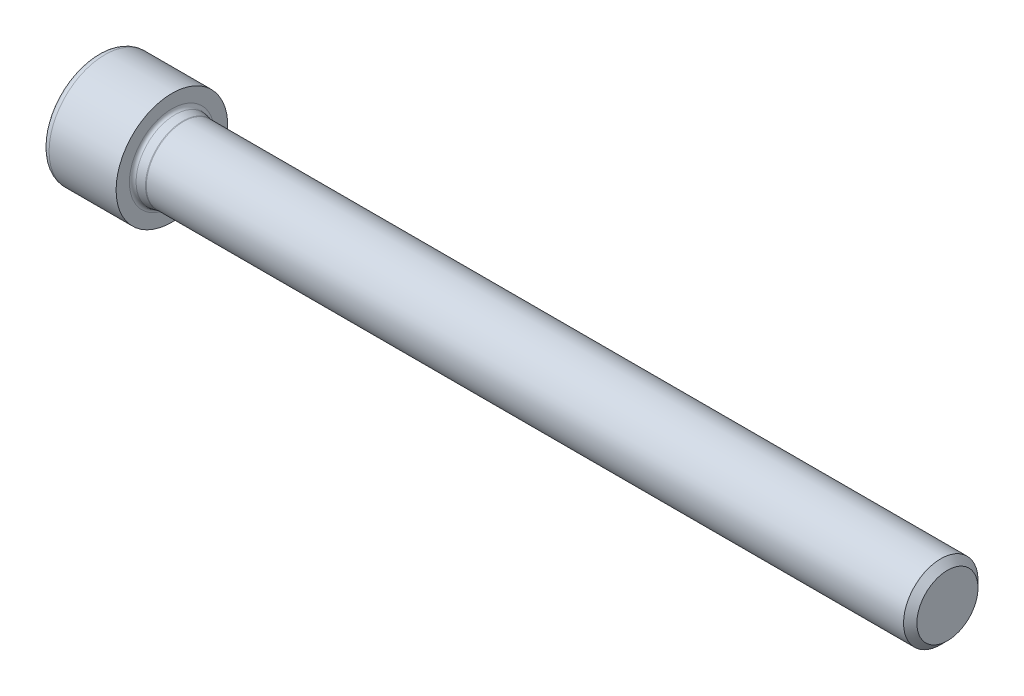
ISO-10303-21;
HEADER;
FILE_DESCRIPTION(('STEP AP214'),'2;1');
FILE_NAME('part.step','',(''),(''),'','','');
FILE_SCHEMA(('AUTOMOTIVE_DESIGN { 1 0 10303 214 1 1 1 1 }'));
ENDSEC;
DATA;
#1=APPLICATION_CONTEXT('core data for automotive mechanical design processes');
#2=APPLICATION_PROTOCOL_DEFINITION('international standard','automotive_design',2000,#1);
#3=PRODUCT_CONTEXT('',#1,'mechanical');
#4=PRODUCT('Part','Part','',(#3));
#5=PRODUCT_RELATED_PRODUCT_CATEGORY('part','',(#4));
#6=PRODUCT_DEFINITION_FORMATION('','',#4);
#7=PRODUCT_DEFINITION_CONTEXT('part definition',#1,'design');
#8=PRODUCT_DEFINITION('design','',#6,#7);
#9=PRODUCT_DEFINITION_SHAPE('','',#8);
#10=(LENGTH_UNIT() NAMED_UNIT(*) SI_UNIT(.MILLI.,.METRE.));
#11=(NAMED_UNIT(*) PLANE_ANGLE_UNIT() SI_UNIT($,.RADIAN.));
#12=(NAMED_UNIT(*) SI_UNIT($,.STERADIAN.) SOLID_ANGLE_UNIT());
#13=UNCERTAINTY_MEASURE_WITH_UNIT(LENGTH_MEASURE(1.E-05),#10,'distance_accuracy_value','');
#14=(GEOMETRIC_REPRESENTATION_CONTEXT(3) GLOBAL_UNCERTAINTY_ASSIGNED_CONTEXT((#13)) GLOBAL_UNIT_ASSIGNED_CONTEXT((#10,
#11,#12)) REPRESENTATION_CONTEXT('',''));
#15=CARTESIAN_POINT('',(0.,0.,0.));
#16=DIRECTION('',(0.,0.,1.));
#17=DIRECTION('',(1.,0.,0.));
#18=AXIS2_PLACEMENT_3D('',#15,#16,#17);
#19=CARTESIAN_POINT('',(-12.,0.,0.));
#20=DIRECTION('',(-1.,0.,0.));
#21=DIRECTION('',(0.,0.,1.));
#22=AXIS2_PLACEMENT_3D('',#19,#20,#21);
#23=CONICAL_SURFACE('',#22,5.715,0.785398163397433);
#24=CARTESIAN_POINT('',(-12.,0.,0.));
#25=DIRECTION('',(-1.,0.,0.));
#26=DIRECTION('',(0.,0.,1.));
#27=AXIS2_PLACEMENT_3D('',#24,#25,#26);
#28=CIRCLE('',#27,5.715);
#29=CARTESIAN_POINT('',(-12.,2.94618112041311,4.89706461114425));
#30=VERTEX_POINT('',#29);
#31=CARTESIAN_POINT('',(-12.,5.71407291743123,0.102935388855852));
#32=VERTEX_POINT('',#31);
#33=EDGE_CURVE('E282',#30,#32,#28,.T.);
#34=ORIENTED_EDGE('',*,*,#33,.T.);
#35=CARTESIAN_POINT('',(-12.0002,5.7142793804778,0.102577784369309));
#36=CARTESIAN_POINT('',(-11.9074807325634,5.61850052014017,0.268471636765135));
#37=CARTESIAN_POINT('',(-11.8204798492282,5.52115568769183,0.437077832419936));
#38=CARTESIAN_POINT('',(-11.6616788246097,5.322857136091,0.780540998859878));
#39=CARTESIAN_POINT('',(-11.5899594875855,5.22188737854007,0.955425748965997));
#40=CARTESIAN_POINT('',(-11.4674205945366,5.01833124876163,1.30799530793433));
#41=CARTESIAN_POINT('',(-11.4163143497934,4.91578923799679,1.4856032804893));
#42=CARTESIAN_POINT('',(-11.3379064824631,4.70861660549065,1.84443680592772));
#43=CARTESIAN_POINT('',(-11.3105521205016,4.60399114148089,2.02565342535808));
#44=CARTESIAN_POINT('',(-11.2858472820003,4.42078631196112,2.34297349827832));
#45=CARTESIAN_POINT('',(-11.2826070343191,4.34239841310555,2.47874532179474));
#46=CARTESIAN_POINT('',(-11.2908807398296,4.18578780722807,2.75000284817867));
#47=CARTESIAN_POINT('',(-11.3023996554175,4.10756516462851,2.8854884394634));
#48=CARTESIAN_POINT('',(-11.3395305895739,3.95190211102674,3.15510475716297));
#49=CARTESIAN_POINT('',(-11.3651560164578,3.87446251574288,3.28923407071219));
#50=CARTESIAN_POINT('',(-11.4291151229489,3.72092999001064,3.5551602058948));
#51=CARTESIAN_POINT('',(-11.4674476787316,3.64483694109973,3.68695723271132));
#52=CARTESIAN_POINT('',(-11.5425556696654,3.51580431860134,3.91044829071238));
#53=CARTESIAN_POINT('',(-11.5766428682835,3.46246508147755,4.00283455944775));
#54=CARTESIAN_POINT('',(-11.6497728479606,3.35664828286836,4.18611463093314));
#55=CARTESIAN_POINT('',(-11.6888152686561,3.30417065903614,4.27700854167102));
#56=CARTESIAN_POINT('',(-11.7711102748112,3.20024952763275,4.45700522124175));
#57=CARTESIAN_POINT('',(-11.8143488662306,3.14880322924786,4.54611282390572));
#58=CARTESIAN_POINT('',(-11.9045865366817,3.04676215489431,4.72285314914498));
#59=CARTESIAN_POINT('',(-11.9515842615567,2.99616708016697,4.81048638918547));
#60=CARTESIAN_POINT('',(-12.0002000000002,2.94597465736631,4.89742221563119));
#61=B_SPLINE_CURVE_WITH_KNOTS('',3,(#35,#36,#37,#38,#39,#40,#41,#42,#43,#44,#45,#46,#47,#48,#49,
#50,#51,#52,#53,#54,#55,#56,#57,#58,#59,#60),.UNSPECIFIED.,.F.,.F.,(4,2,2,2,2,2,2,2,2,2,2,2,4),
(0.,0.638854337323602,1.28100722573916,1.91389253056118,2.54536893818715,3.01512927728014,
3.48504760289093,3.95541336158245,4.42573753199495,4.7615923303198,5.09742271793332,
5.43216928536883,5.76679580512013),.UNSPECIFIED.);
#62=EDGE_CURVE('E247',#32,#30,#61,.T.);
#63=ORIENTED_EDGE('',*,*,#62,.T.);
#64=EDGE_LOOP('',(#34,#63));
#65=FACE_BOUND('',#64,.T.);
#66=ADVANCED_FACE('F37',(#65),#23,.F.);
#67=CARTESIAN_POINT('',(-12.,5.71407291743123,-0.102935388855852));
#68=VERTEX_POINT('',#67);
#69=CARTESIAN_POINT('',(-12.,2.94618112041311,-4.89706461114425));
#70=VERTEX_POINT('',#69);
#71=EDGE_CURVE('E285',#68,#70,#28,.T.);
#72=ORIENTED_EDGE('',*,*,#71,.T.);
#73=CARTESIAN_POINT('',(-12.0002000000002,2.94597465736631,-4.89742221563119));
#74=CARTESIAN_POINT('',(-11.9074807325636,3.04175351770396,-4.73152836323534));
#75=CARTESIAN_POINT('',(-11.8204798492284,3.13909835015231,-4.56292216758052));
#76=CARTESIAN_POINT('',(-11.6616788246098,3.33739690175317,-4.21945900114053));
#77=CARTESIAN_POINT('',(-11.5899594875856,3.43836665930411,-4.04457425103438));
#78=CARTESIAN_POINT('',(-11.4674205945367,3.64192278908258,-3.692004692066));
#79=CARTESIAN_POINT('',(-11.4163143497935,3.74446479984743,-3.51439671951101));
#80=CARTESIAN_POINT('',(-11.3379064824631,3.95163743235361,-3.15556319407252));
#81=CARTESIAN_POINT('',(-11.3105521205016,4.05626289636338,-2.97434657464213));
#82=CARTESIAN_POINT('',(-11.2858472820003,4.23946772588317,-2.65702650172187));
#83=CARTESIAN_POINT('',(-11.2826070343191,4.31785562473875,-2.52125467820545));
#84=CARTESIAN_POINT('',(-11.2908807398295,4.47446623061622,-2.24999715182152));
#85=CARTESIAN_POINT('',(-11.3023996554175,4.55268887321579,-2.11451156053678));
#86=CARTESIAN_POINT('',(-11.3395305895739,4.70835192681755,-1.84489524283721));
#87=CARTESIAN_POINT('',(-11.3651560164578,4.78579152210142,-1.71076592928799));
#88=CARTESIAN_POINT('',(-11.4291151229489,4.93932404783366,-1.44483979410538));
#89=CARTESIAN_POINT('',(-11.4674476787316,5.01541709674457,-1.31304276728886));
#90=CARTESIAN_POINT('',(-11.5425556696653,5.14444971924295,-1.08955170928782));
#91=CARTESIAN_POINT('',(-11.5766428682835,5.19778895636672,-0.997165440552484));
#92=CARTESIAN_POINT('',(-11.6497728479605,5.30360575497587,-0.813885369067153));
#93=CARTESIAN_POINT('',(-11.688815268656,5.35608337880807,-0.722991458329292));
#94=CARTESIAN_POINT('',(-11.7711102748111,5.46000451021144,-0.542994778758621));
#95=CARTESIAN_POINT('',(-11.8143488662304,5.51145080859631,-0.453887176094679));
#96=CARTESIAN_POINT('',(-11.9045865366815,5.61349188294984,-0.277146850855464));
#97=CARTESIAN_POINT('',(-11.9515842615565,5.66408695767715,-0.189513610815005));
#98=CARTESIAN_POINT('',(-12.0002,5.7142793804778,-0.102577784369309));
#99=B_SPLINE_CURVE_WITH_KNOTS('',3,(#73,#74,#75,#76,#77,#78,#79,#80,#81,#82,#83,#84,#85,#86,#87,
#88,#89,#90,#91,#92,#93,#94,#95,#96,#97,#98),.UNSPECIFIED.,.F.,.F.,(4,2,2,2,2,2,2,2,2,2,2,2,4),
(0.,0.638854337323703,1.28100722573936,1.91389253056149,2.54536893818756,3.01512927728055,
3.48504760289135,3.95541336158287,4.42573753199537,4.76159233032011,5.09742271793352,
5.43216928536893,5.76679580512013),.UNSPECIFIED.);
#100=EDGE_CURVE('E242',#70,#68,#99,.T.);
#101=ORIENTED_EDGE('',*,*,#100,.T.);
#102=EDGE_LOOP('',(#72,#101));
#103=FACE_BOUND('',#102,.T.);
#104=ADVANCED_FACE('F273',(#103),#23,.F.);
#105=CARTESIAN_POINT('',(-12.,2.76789179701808,-5.));
#106=VERTEX_POINT('',#105);
#107=CARTESIAN_POINT('',(-12.,-2.76789179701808,-5.));
#108=VERTEX_POINT('',#107);
#109=EDGE_CURVE('E291',#106,#108,#28,.T.);
#110=ORIENTED_EDGE('',*,*,#109,.T.);
#111=CARTESIAN_POINT('',(-14.0958810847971,-6.00082188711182,-5.));
#112=CARTESIAN_POINT('',(-13.9844552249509,-5.85575345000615,-5.));
#113=CARTESIAN_POINT('',(-13.8740344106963,-5.70990068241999,-5.));
#114=CARTESIAN_POINT('',(-13.6556612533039,-5.41630686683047,-5.));
#115=CARTESIAN_POINT('',(-13.5477095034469,-5.26856537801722,-5.));
#116=CARTESIAN_POINT('',(-13.3339645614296,-4.96979459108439,-5.));
#117=CARTESIAN_POINT('',(-13.2281944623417,-4.81874871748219,-5.));
#118=CARTESIAN_POINT('',(-13.020357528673,-4.51413854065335,-5.));
#119=CARTESIAN_POINT('',(-12.9182904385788,-4.36057441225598,-5.));
#120=CARTESIAN_POINT('',(-12.7124289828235,-4.04076170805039,-5.));
#121=CARTESIAN_POINT('',(-12.6089292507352,-3.87432252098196,-5.));
#122=CARTESIAN_POINT('',(-12.4083862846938,-3.53753716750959,-5.));
#123=CARTESIAN_POINT('',(-12.3113441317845,-3.36719035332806,-5.));
#124=CARTESIAN_POINT('',(-12.1257854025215,-3.02254857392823,-5.));
#125=CARTESIAN_POINT('',(-12.0372437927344,-2.84826719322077,-5.));
#126=CARTESIAN_POINT('',(-11.8706698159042,-2.49479232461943,-5.));
#127=CARTESIAN_POINT('',(-11.7926325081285,-2.31560119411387,-5.));
#128=CARTESIAN_POINT('',(-11.6568266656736,-1.96959427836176,-5.));
#129=CARTESIAN_POINT('',(-11.5978255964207,-1.80326723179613,-5.));
#130=CARTESIAN_POINT('',(-11.4931390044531,-1.46639577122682,-5.));
#131=CARTESIAN_POINT('',(-11.4474543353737,-1.29585108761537,-5.));
#132=CARTESIAN_POINT('',(-11.3726268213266,-0.954521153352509,-5.));
#133=CARTESIAN_POINT('',(-11.3431850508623,-0.783802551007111,-5.));
#134=CARTESIAN_POINT('',(-11.3014540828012,-0.440270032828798,-5.));
#135=CARTESIAN_POINT('',(-11.2891613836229,-0.26745655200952,-5.));
#136=CARTESIAN_POINT('',(-11.2827640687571,0.0710713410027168,-5.));
#137=CARTESIAN_POINT('',(-11.2879002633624,0.236771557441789,-5.));
#138=CARTESIAN_POINT('',(-11.3143396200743,0.566868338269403,-5.));
#139=CARTESIAN_POINT('',(-11.3356442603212,0.731264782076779,-5.));
#140=CARTESIAN_POINT('',(-11.3935817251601,1.06034957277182,-5.));
#141=CARTESIAN_POINT('',(-11.4304843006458,1.22498962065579,-5.));
#142=CARTESIAN_POINT('',(-11.517577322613,1.55064779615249,-5.));
#143=CARTESIAN_POINT('',(-11.5677669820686,1.71166613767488,-5.));
#144=CARTESIAN_POINT('',(-11.6826139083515,2.0394163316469,-5.));
#145=CARTESIAN_POINT('',(-11.747963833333,2.20590271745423,-5.));
#146=CARTESIAN_POINT('',(-11.8887553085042,2.53459014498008,-5.));
#147=CARTESIAN_POINT('',(-11.9642014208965,2.69678920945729,-5.));
#148=CARTESIAN_POINT('',(-12.1233957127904,3.01766998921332,-5.));
#149=CARTESIAN_POINT('',(-12.2071695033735,3.17633889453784,-5.));
#150=CARTESIAN_POINT('',(-12.3811749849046,3.49003975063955,-5.));
#151=CARTESIAN_POINT('',(-12.471405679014,3.6450722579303,-5.));
#152=CARTESIAN_POINT('',(-12.6524775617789,3.94439554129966,-5.));
#153=CARTESIAN_POINT('',(-12.7430683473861,4.08883860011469,-5.));
#154=CARTESIAN_POINT('',(-12.9281026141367,4.37524319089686,-5.));
#155=CARTESIAN_POINT('',(-13.0225463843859,4.51720453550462,-5.));
#156=CARTESIAN_POINT('',(-13.2138296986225,4.79782824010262,-5.));
#157=CARTESIAN_POINT('',(-13.3106438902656,4.93650794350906,-5.));
#158=CARTESIAN_POINT('',(-13.5068650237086,5.21196535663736,-5.));
#159=CARTESIAN_POINT('',(-13.6062712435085,5.34874358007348,-5.));
#160=CARTESIAN_POINT('',(-13.706738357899,5.484724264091,-5.));
#161=B_SPLINE_CURVE_WITH_KNOTS('',3,(#111,#112,#113,#114,#115,#116,#117,#118,#119,#120,#121,
#122,#123,#124,#125,#126,#127,#128,#129,#130,#131,#132,#133,#134,#135,#136,#137,#138,#139,#140,
#141,#142,#143,#144,#145,#146,#147,#148,#149,#150,#151,#152,#153,#154,#155,#156,#157,#158,#159,
#160),.UNSPECIFIED.,.F.,.F.,(4,2,2,2,2,2,2,2,2,2,2,2,2,2,2,2,2,2,2,2,2,2,2,2,4),(0.,
0.548777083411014,1.09768467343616,1.65082914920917,2.20393538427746,2.7918051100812,
3.37977300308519,3.96595254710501,4.55185540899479,5.08084366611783,5.60986582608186,
6.12879642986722,6.64762106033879,7.14414134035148,7.64070701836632,8.1462363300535,
8.65173570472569,9.18788255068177,9.72427249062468,10.2623663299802,10.8003772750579,
11.3118076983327,11.8232765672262,12.3306351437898,12.8378538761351),.UNSPECIFIED.);
#162=EDGE_CURVE('E236',#108,#106,#161,.T.);
#163=ORIENTED_EDGE('',*,*,#162,.T.);
#164=EDGE_LOOP('',(#110,#163));
#165=FACE_BOUND('',#164,.T.);
#166=ADVANCED_FACE('F278',(#165),#23,.F.);
#167=CARTESIAN_POINT('',(-12.,-2.94618112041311,-4.89706461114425));
#168=VERTEX_POINT('',#167);
#169=CARTESIAN_POINT('',(-12.,-5.71407291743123,-0.102935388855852));
#170=VERTEX_POINT('',#169);
#171=EDGE_CURVE('E298',#168,#170,#28,.T.);
#172=ORIENTED_EDGE('',*,*,#171,.T.);
#173=CARTESIAN_POINT('',(-12.0002,-5.7142793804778,-0.102577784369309));
#174=CARTESIAN_POINT('',(-11.9074807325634,-5.61850052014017,-0.268471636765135));
#175=CARTESIAN_POINT('',(-11.8204798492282,-5.52115568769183,-0.437077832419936));
#176=CARTESIAN_POINT('',(-11.6616788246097,-5.322857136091,-0.780540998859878));
#177=CARTESIAN_POINT('',(-11.5899594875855,-5.22188737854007,-0.955425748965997));
#178=CARTESIAN_POINT('',(-11.4674205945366,-5.01833124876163,-1.30799530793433));
#179=CARTESIAN_POINT('',(-11.4163143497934,-4.91578923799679,-1.4856032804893));
#180=CARTESIAN_POINT('',(-11.3379064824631,-4.70861660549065,-1.84443680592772));
#181=CARTESIAN_POINT('',(-11.3105521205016,-4.60399114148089,-2.02565342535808));
#182=CARTESIAN_POINT('',(-11.2858472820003,-4.42078631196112,-2.34297349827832));
#183=CARTESIAN_POINT('',(-11.2826070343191,-4.34239841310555,-2.47874532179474));
#184=CARTESIAN_POINT('',(-11.2908807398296,-4.18578780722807,-2.75000284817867));
#185=CARTESIAN_POINT('',(-11.3023996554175,-4.10756516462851,-2.8854884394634));
#186=CARTESIAN_POINT('',(-11.3395305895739,-3.95190211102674,-3.15510475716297));
#187=CARTESIAN_POINT('',(-11.3651560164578,-3.87446251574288,-3.28923407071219));
#188=CARTESIAN_POINT('',(-11.4291151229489,-3.72092999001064,-3.5551602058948));
#189=CARTESIAN_POINT('',(-11.4674476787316,-3.64483694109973,-3.68695723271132));
#190=CARTESIAN_POINT('',(-11.5425556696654,-3.51580431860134,-3.91044829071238));
#191=CARTESIAN_POINT('',(-11.5766428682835,-3.46246508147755,-4.00283455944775));
#192=CARTESIAN_POINT('',(-11.6497728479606,-3.35664828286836,-4.18611463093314));
#193=CARTESIAN_POINT('',(-11.6888152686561,-3.30417065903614,-4.27700854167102));
#194=CARTESIAN_POINT('',(-11.7711102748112,-3.20024952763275,-4.45700522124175));
#195=CARTESIAN_POINT('',(-11.8143488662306,-3.14880322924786,-4.54611282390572));
#196=CARTESIAN_POINT('',(-11.9045865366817,-3.04676215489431,-4.72285314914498));
#197=CARTESIAN_POINT('',(-11.9515842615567,-2.99616708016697,-4.81048638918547));
#198=CARTESIAN_POINT('',(-12.0002000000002,-2.94597465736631,-4.89742221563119));
#199=B_SPLINE_CURVE_WITH_KNOTS('',3,(#173,#174,#175,#176,#177,#178,#179,#180,#181,#182,#183,
#184,#185,#186,#187,#188,#189,#190,#191,#192,#193,#194,#195,#196,#197,#198),.UNSPECIFIED.,.F.,
.F.,(4,2,2,2,2,2,2,2,2,2,2,2,4),(0.,0.638854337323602,1.28100722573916,1.91389253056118,
2.54536893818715,3.01512927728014,3.48504760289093,3.95541336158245,4.42573753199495,
4.7615923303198,5.09742271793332,5.43216928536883,5.76679580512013),.UNSPECIFIED.);
#200=EDGE_CURVE('E230',#170,#168,#199,.T.);
#201=ORIENTED_EDGE('',*,*,#200,.T.);
#202=EDGE_LOOP('',(#172,#201));
#203=FACE_BOUND('',#202,.T.);
#204=ADVANCED_FACE('F465',(#203),#23,.F.);
#205=CARTESIAN_POINT('',(-12.,-5.71407291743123,0.102935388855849));
#206=VERTEX_POINT('',#205);
#207=CARTESIAN_POINT('',(-12.,-2.94618112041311,4.89706461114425));
#208=VERTEX_POINT('',#207);
#209=EDGE_CURVE('E294',#206,#208,#28,.T.);
#210=ORIENTED_EDGE('',*,*,#209,.T.);
#211=CARTESIAN_POINT('',(-12.0002000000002,-2.94597465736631,4.89742221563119));
#212=CARTESIAN_POINT('',(-11.9074807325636,-3.04175351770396,4.73152836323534));
#213=CARTESIAN_POINT('',(-11.8204798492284,-3.13909835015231,4.56292216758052));
#214=CARTESIAN_POINT('',(-11.6616788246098,-3.33739690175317,4.21945900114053));
#215=CARTESIAN_POINT('',(-11.5899594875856,-3.43836665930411,4.04457425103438));
#216=CARTESIAN_POINT('',(-11.4674205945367,-3.64192278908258,3.692004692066));
#217=CARTESIAN_POINT('',(-11.4163143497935,-3.74446479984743,3.51439671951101));
#218=CARTESIAN_POINT('',(-11.3379064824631,-3.95163743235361,3.15556319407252));
#219=CARTESIAN_POINT('',(-11.3105521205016,-4.05626289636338,2.97434657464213));
#220=CARTESIAN_POINT('',(-11.2858472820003,-4.23946772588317,2.65702650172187));
#221=CARTESIAN_POINT('',(-11.2826070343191,-4.31785562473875,2.52125467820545));
#222=CARTESIAN_POINT('',(-11.2908807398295,-4.47446623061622,2.24999715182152));
#223=CARTESIAN_POINT('',(-11.3023996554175,-4.55268887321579,2.11451156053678));
#224=CARTESIAN_POINT('',(-11.3395305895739,-4.70835192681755,1.84489524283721));
#225=CARTESIAN_POINT('',(-11.3651560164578,-4.78579152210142,1.71076592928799));
#226=CARTESIAN_POINT('',(-11.4291151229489,-4.93932404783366,1.44483979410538));
#227=CARTESIAN_POINT('',(-11.4674476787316,-5.01541709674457,1.31304276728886));
#228=CARTESIAN_POINT('',(-11.5425556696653,-5.14444971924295,1.08955170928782));
#229=CARTESIAN_POINT('',(-11.5766428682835,-5.19778895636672,0.997165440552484));
#230=CARTESIAN_POINT('',(-11.6497728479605,-5.30360575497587,0.813885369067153));
#231=CARTESIAN_POINT('',(-11.688815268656,-5.35608337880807,0.722991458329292));
#232=CARTESIAN_POINT('',(-11.7711102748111,-5.46000451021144,0.542994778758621));
#233=CARTESIAN_POINT('',(-11.8143488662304,-5.51145080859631,0.453887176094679));
#234=CARTESIAN_POINT('',(-11.9045865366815,-5.61349188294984,0.277146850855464));
#235=CARTESIAN_POINT('',(-11.9515842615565,-5.66408695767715,0.189513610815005));
#236=CARTESIAN_POINT('',(-12.0002,-5.7142793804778,0.102577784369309));
#237=B_SPLINE_CURVE_WITH_KNOTS('',3,(#211,#212,#213,#214,#215,#216,#217,#218,#219,#220,#221,
#222,#223,#224,#225,#226,#227,#228,#229,#230,#231,#232,#233,#234,#235,#236),.UNSPECIFIED.,.F.,
.F.,(4,2,2,2,2,2,2,2,2,2,2,2,4),(0.,0.638854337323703,1.28100722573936,1.91389253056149,
2.54536893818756,3.01512927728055,3.48504760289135,3.95541336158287,4.42573753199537,
4.76159233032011,5.09742271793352,5.43216928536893,5.76679580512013),.UNSPECIFIED.);
#238=EDGE_CURVE('E208',#208,#206,#237,.T.);
#239=ORIENTED_EDGE('',*,*,#238,.T.);
#240=EDGE_LOOP('',(#210,#239));
#241=FACE_BOUND('',#240,.T.);
#242=ADVANCED_FACE('F221',(#241),#23,.F.);
#243=CARTESIAN_POINT('',(-12.,-2.76789179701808,5.));
#244=VERTEX_POINT('',#243);
#245=CARTESIAN_POINT('',(-12.,2.76789179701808,5.));
#246=VERTEX_POINT('',#245);
#247=EDGE_CURVE('E287',#244,#246,#28,.T.);
#248=ORIENTED_EDGE('',*,*,#247,.T.);
#249=CARTESIAN_POINT('',(-14.0958810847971,-6.00082188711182,5.));
#250=CARTESIAN_POINT('',(-13.9844552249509,-5.85575345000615,5.));
#251=CARTESIAN_POINT('',(-13.8740344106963,-5.70990068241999,5.));
#252=CARTESIAN_POINT('',(-13.6556612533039,-5.41630686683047,5.));
#253=CARTESIAN_POINT('',(-13.5477095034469,-5.26856537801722,5.));
#254=CARTESIAN_POINT('',(-13.3339645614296,-4.96979459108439,5.));
#255=CARTESIAN_POINT('',(-13.2281944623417,-4.81874871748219,5.));
#256=CARTESIAN_POINT('',(-13.020357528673,-4.51413854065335,5.));
#257=CARTESIAN_POINT('',(-12.9182904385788,-4.36057441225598,5.));
#258=CARTESIAN_POINT('',(-12.7124289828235,-4.04076170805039,5.));
#259=CARTESIAN_POINT('',(-12.6089292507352,-3.87432252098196,5.));
#260=CARTESIAN_POINT('',(-12.4083862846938,-3.53753716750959,5.));
#261=CARTESIAN_POINT('',(-12.3113441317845,-3.36719035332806,5.));
#262=CARTESIAN_POINT('',(-12.1257854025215,-3.02254857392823,5.));
#263=CARTESIAN_POINT('',(-12.0372437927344,-2.84826719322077,5.));
#264=CARTESIAN_POINT('',(-11.8706698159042,-2.49479232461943,5.));
#265=CARTESIAN_POINT('',(-11.7926325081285,-2.31560119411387,5.));
#266=CARTESIAN_POINT('',(-11.6568266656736,-1.96959427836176,5.));
#267=CARTESIAN_POINT('',(-11.5978255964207,-1.80326723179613,5.));
#268=CARTESIAN_POINT('',(-11.4931390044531,-1.46639577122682,5.));
#269=CARTESIAN_POINT('',(-11.4474543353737,-1.29585108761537,5.));
#270=CARTESIAN_POINT('',(-11.3726268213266,-0.954521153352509,5.));
#271=CARTESIAN_POINT('',(-11.3431850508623,-0.783802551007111,5.));
#272=CARTESIAN_POINT('',(-11.3014540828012,-0.440270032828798,5.));
#273=CARTESIAN_POINT('',(-11.2891613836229,-0.26745655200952,5.));
#274=CARTESIAN_POINT('',(-11.2827640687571,0.0710713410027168,5.));
#275=CARTESIAN_POINT('',(-11.2879002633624,0.236771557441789,5.));
#276=CARTESIAN_POINT('',(-11.3143396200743,0.566868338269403,5.));
#277=CARTESIAN_POINT('',(-11.3356442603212,0.731264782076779,5.));
#278=CARTESIAN_POINT('',(-11.3935817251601,1.06034957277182,5.));
#279=CARTESIAN_POINT('',(-11.4304843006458,1.22498962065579,5.));
#280=CARTESIAN_POINT('',(-11.517577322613,1.55064779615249,5.));
#281=CARTESIAN_POINT('',(-11.5677669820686,1.71166613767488,5.));
#282=CARTESIAN_POINT('',(-11.6826139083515,2.0394163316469,5.));
#283=CARTESIAN_POINT('',(-11.747963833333,2.20590271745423,5.));
#284=CARTESIAN_POINT('',(-11.8887553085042,2.53459014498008,5.));
#285=CARTESIAN_POINT('',(-11.9642014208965,2.69678920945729,5.));
#286=CARTESIAN_POINT('',(-12.1233957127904,3.01766998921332,5.));
#287=CARTESIAN_POINT('',(-12.2071695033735,3.17633889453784,5.));
#288=CARTESIAN_POINT('',(-12.3811749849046,3.49003975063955,5.));
#289=CARTESIAN_POINT('',(-12.471405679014,3.6450722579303,5.));
#290=CARTESIAN_POINT('',(-12.6524775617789,3.94439554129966,5.));
#291=CARTESIAN_POINT('',(-12.7430683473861,4.08883860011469,5.));
#292=CARTESIAN_POINT('',(-12.9281026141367,4.37524319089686,5.));
#293=CARTESIAN_POINT('',(-13.0225463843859,4.51720453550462,5.));
#294=CARTESIAN_POINT('',(-13.2138296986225,4.79782824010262,5.));
#295=CARTESIAN_POINT('',(-13.3106438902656,4.93650794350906,5.));
#296=CARTESIAN_POINT('',(-13.5068650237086,5.21196535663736,5.));
#297=CARTESIAN_POINT('',(-13.6062712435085,5.34874358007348,5.));
#298=CARTESIAN_POINT('',(-13.706738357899,5.484724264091,5.));
#299=B_SPLINE_CURVE_WITH_KNOTS('',3,(#249,#250,#251,#252,#253,#254,#255,#256,#257,#258,#259,
#260,#261,#262,#263,#264,#265,#266,#267,#268,#269,#270,#271,#272,#273,#274,#275,#276,#277,#278,
#279,#280,#281,#282,#283,#284,#285,#286,#287,#288,#289,#290,#291,#292,#293,#294,#295,#296,#297,
#298),.UNSPECIFIED.,.F.,.F.,(4,2,2,2,2,2,2,2,2,2,2,2,2,2,2,2,2,2,2,2,2,2,2,2,4),(0.,
0.548777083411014,1.09768467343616,1.65082914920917,2.20393538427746,2.7918051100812,
3.37977300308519,3.96595254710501,4.55185540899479,5.08084366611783,5.60986582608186,
6.12879642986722,6.64762106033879,7.14414134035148,7.64070701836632,8.1462363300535,
8.65173570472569,9.18788255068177,9.72427249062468,10.2623663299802,10.8003772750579,
11.3118076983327,11.8232765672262,12.3306351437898,12.8378538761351),.UNSPECIFIED.);
#300=EDGE_CURVE('E195',#246,#244,#299,.F.);
#301=ORIENTED_EDGE('',*,*,#300,.T.);
#302=EDGE_LOOP('',(#248,#301));
#303=FACE_BOUND('',#302,.T.);
#304=ADVANCED_FACE('F216',(#303),#23,.F.);
#305=CARTESIAN_POINT('',(-12.,0.,-5.715));
#306=DIRECTION('',(1.,0.,0.));
#307=DIRECTION('',(0.,0.,-1.));
#308=AXIS2_PLACEMENT_3D('',#305,#306,#307);
#309=PLANE('',#308);
#310=DIRECTION('',(0.,0.500000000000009,0.866025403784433));
#311=VECTOR('',#310,1.);
#312=CARTESIAN_POINT('',(-12.,1.85545942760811,-6.78625));
#313=LINE('',#312,#311);
#314=CARTESIAN_POINT('',(-12.,5.7735026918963,0.));
#315=VERTEX_POINT('',#314);
#316=EDGE_CURVE('E46',#68,#315,#313,.T.);
#317=ORIENTED_EDGE('',*,*,#316,.T.);
#318=DIRECTION('',(0.,-0.500000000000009,0.866025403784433));
#319=VECTOR('',#318,1.);
#320=CARTESIAN_POINT('',(-12.,6.80479461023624,-1.7862499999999));
#321=LINE('',#320,#319);
#322=EDGE_CURVE('E11',#315,#32,#321,.T.);
#323=ORIENTED_EDGE('',*,*,#322,.T.);
#324=ORIENTED_EDGE('',*,*,#33,.F.);
#325=CARTESIAN_POINT('',(-12.,2.8867513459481,5.));
#326=VERTEX_POINT('',#325);
#327=EDGE_CURVE('E48',#30,#326,#321,.T.);
#328=ORIENTED_EDGE('',*,*,#327,.T.);
#329=DIRECTION('',(0.,-1.,0.));
#330=VECTOR('',#329,1.);
#331=CARTESIAN_POINT('',(-12.,0.,5.));
#332=LINE('',#331,#330);
#333=EDGE_CURVE('E170',#326,#246,#332,.T.);
#334=ORIENTED_EDGE('',*,*,#333,.T.);
#335=ORIENTED_EDGE('',*,*,#247,.F.);
#336=CARTESIAN_POINT('',(-12.,-2.8867513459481,5.));
#337=VERTEX_POINT('',#336);
#338=EDGE_CURVE('E408',#244,#337,#332,.T.);
#339=ORIENTED_EDGE('',*,*,#338,.T.);
#340=DIRECTION('',(0.,-0.500000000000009,-0.866025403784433));
#341=VECTOR('',#340,1.);
#342=CARTESIAN_POINT('',(-12.,-6.80479461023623,-1.7862499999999));
#343=LINE('',#342,#341);
#344=EDGE_CURVE('E405',#337,#208,#343,.T.);
#345=ORIENTED_EDGE('',*,*,#344,.T.);
#346=ORIENTED_EDGE('',*,*,#209,.F.);
#347=CARTESIAN_POINT('',(-12.,-5.7735026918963,0.));
#348=VERTEX_POINT('',#347);
#349=EDGE_CURVE('E403',#206,#348,#343,.T.);
#350=ORIENTED_EDGE('',*,*,#349,.T.);
#351=DIRECTION('',(0.,0.500000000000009,-0.866025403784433));
#352=VECTOR('',#351,1.);
#353=CARTESIAN_POINT('',(-12.,-1.85545942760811,-6.78625));
#354=LINE('',#353,#352);
#355=EDGE_CURVE('E401',#348,#170,#354,.T.);
#356=ORIENTED_EDGE('',*,*,#355,.T.);
#357=ORIENTED_EDGE('',*,*,#171,.F.);
#358=CARTESIAN_POINT('',(-12.,-2.8867513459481,-5.));
#359=VERTEX_POINT('',#358);
#360=EDGE_CURVE('E399',#168,#359,#354,.T.);
#361=ORIENTED_EDGE('',*,*,#360,.T.);
#362=DIRECTION('',(0.,1.,0.));
#363=VECTOR('',#362,1.);
#364=CARTESIAN_POINT('',(-12.,0.,-5.));
#365=LINE('',#364,#363);
#366=EDGE_CURVE('E395',#359,#108,#365,.T.);
#367=ORIENTED_EDGE('',*,*,#366,.T.);
#368=ORIENTED_EDGE('',*,*,#109,.F.);
#369=CARTESIAN_POINT('',(-12.,2.8867513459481,-5.));
#370=VERTEX_POINT('',#369);
#371=EDGE_CURVE('E393',#106,#370,#365,.T.);
#372=ORIENTED_EDGE('',*,*,#371,.T.);
#373=EDGE_CURVE('E41',#370,#70,#313,.T.);
#374=ORIENTED_EDGE('',*,*,#373,.T.);
#375=ORIENTED_EDGE('',*,*,#71,.F.);
#376=EDGE_LOOP('',(#317,#323,#324,#328,#334,#335,#339,#345,#346,#350,#356,#357,#361,#367,#368,
#372,#374,#375));
#377=FACE_BOUND('',#376,.T.);
#378=CARTESIAN_POINT('',(-12.,0.,0.));
#379=DIRECTION('',(-1.,0.,0.));
#380=DIRECTION('',(0.,0.,1.));
#381=AXIS2_PLACEMENT_3D('',#378,#379,#380);
#382=CIRCLE('',#381,7.8);
#383=CARTESIAN_POINT('',(-12.,0.,7.8));
#384=VERTEX_POINT('',#383);
#385=EDGE_CURVE('E295',#384,#384,#382,.T.);
#386=ORIENTED_EDGE('',*,*,#385,.T.);
#387=EDGE_LOOP('',(#386));
#388=FACE_BOUND('',#387,.T.);
#389=ADVANCED_FACE('F220',(#377,#388),#309,.F.);
#390=CARTESIAN_POINT('',(-10.8000000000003,0.,0.));
#391=DIRECTION('',(-1.,0.,0.));
#392=DIRECTION('',(0.,0.,1.));
#393=AXIS2_PLACEMENT_3D('',#390,#391,#392);
#394=TOROIDAL_SURFACE('',#393,7.80000000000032,1.19999999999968);
#395=ORIENTED_EDGE('',*,*,#385,.F.);
#396=EDGE_LOOP('',(#395));
#397=FACE_BOUND('',#396,.T.);
#398=CARTESIAN_POINT('',(-10.8,0.,0.));
#399=DIRECTION('',(-1.,0.,0.));
#400=DIRECTION('',(0.,0.,1.));
#401=AXIS2_PLACEMENT_3D('',#398,#399,#400);
#402=CIRCLE('',#401,9.);
#403=CARTESIAN_POINT('',(-10.8,0.,9.));
#404=VERTEX_POINT('',#403);
#405=EDGE_CURVE('E300',#404,#404,#402,.T.);
#406=ORIENTED_EDGE('',*,*,#405,.T.);
#407=EDGE_LOOP('',(#406));
#408=FACE_BOUND('',#407,.T.);
#409=ADVANCED_FACE('F365',(#397,#408),#394,.T.);
#410=CARTESIAN_POINT('',(125.,0.,0.));
#411=DIRECTION('',(-1.,0.,0.));
#412=DIRECTION('',(0.,0.,1.));
#413=AXIS2_PLACEMENT_3D('',#410,#411,#412);
#414=CYLINDRICAL_SURFACE('',#413,9.);
#415=ORIENTED_EDGE('',*,*,#405,.F.);
#416=EDGE_LOOP('',(#415));
#417=FACE_BOUND('',#416,.T.);
#418=CARTESIAN_POINT('',(0.,0.,0.));
#419=DIRECTION('',(-1.,0.,0.));
#420=DIRECTION('',(0.,0.,1.));
#421=AXIS2_PLACEMENT_3D('',#418,#419,#420);
#422=CIRCLE('',#421,9.);
#423=CARTESIAN_POINT('',(0.,0.,9.));
#424=VERTEX_POINT('',#423);
#425=EDGE_CURVE('E304',#424,#424,#422,.T.);
#426=ORIENTED_EDGE('',*,*,#425,.T.);
#427=EDGE_LOOP('',(#426));
#428=FACE_BOUND('',#427,.T.);
#429=ADVANCED_FACE('F362',(#417,#428),#414,.T.);
#430=CARTESIAN_POINT('',(0.,0.,-9.));
#431=DIRECTION('',(-1.,0.,0.));
#432=DIRECTION('',(0.,0.,1.));
#433=AXIS2_PLACEMENT_3D('',#430,#431,#432);
#434=PLANE('',#433);
#435=ORIENTED_EDGE('',*,*,#425,.F.);
#436=EDGE_LOOP('',(#435));
#437=FACE_BOUND('',#436,.T.);
#438=CARTESIAN_POINT('',(0.,0.,0.));
#439=DIRECTION('',(-1.,0.,0.));
#440=DIRECTION('',(0.,0.,1.));
#441=AXIS2_PLACEMENT_3D('',#438,#439,#440);
#442=CIRCLE('',#441,6.85);
#443=CARTESIAN_POINT('',(0.,0.,6.85));
#444=VERTEX_POINT('',#443);
#445=EDGE_CURVE('E309',#444,#444,#442,.T.);
#446=ORIENTED_EDGE('',*,*,#445,.T.);
#447=EDGE_LOOP('',(#446));
#448=FACE_BOUND('',#447,.T.);
#449=ADVANCED_FACE('F358',(#437,#448),#434,.F.);
#450=CARTESIAN_POINT('',(0.600000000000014,0.,0.));
#451=DIRECTION('',(-1.,0.,0.));
#452=DIRECTION('',(0.,0.,1.));
#453=AXIS2_PLACEMENT_3D('',#450,#451,#452);
#454=TOROIDAL_SURFACE('',#453,6.85,0.600000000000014);
#455=ORIENTED_EDGE('',*,*,#445,.F.);
#456=EDGE_LOOP('',(#455));
#457=FACE_BOUND('',#456,.T.);
#458=CARTESIAN_POINT('',(0.484113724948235,0.,0.));
#459=DIRECTION('',(-1.,0.,0.));
#460=DIRECTION('',(0.,0.,1.));
#461=AXIS2_PLACEMENT_3D('',#458,#459,#460);
#462=CIRCLE('',#461,6.261297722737);
#463=CARTESIAN_POINT('',(0.484113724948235,0.,6.261297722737));
#464=VERTEX_POINT('',#463);
#465=EDGE_CURVE('E312',#464,#464,#462,.T.);
#466=ORIENTED_EDGE('',*,*,#465,.T.);
#467=EDGE_LOOP('',(#466));
#468=FACE_BOUND('',#467,.T.);
#469=ADVANCED_FACE('F354',(#457,#468),#454,.F.);
#470=CARTESIAN_POINT('',(1.7541137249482,0.,0.));
#471=DIRECTION('',(-1.,0.,0.));
#472=DIRECTION('',(0.,0.,1.));
#473=AXIS2_PLACEMENT_3D('',#470,#471,#472);
#474=CONICAL_SURFACE('',#473,6.011297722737,0.194365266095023);
#475=ORIENTED_EDGE('',*,*,#465,.F.);
#476=EDGE_LOOP('',(#475));
#477=FACE_BOUND('',#476,.T.);
#478=CARTESIAN_POINT('',(1.7541137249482,0.,0.));
#479=DIRECTION('',(-1.,0.,0.));
#480=DIRECTION('',(0.,0.,1.));
#481=AXIS2_PLACEMENT_3D('',#478,#479,#480);
#482=CIRCLE('',#481,6.011297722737);
#483=CARTESIAN_POINT('',(1.7541137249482,0.,6.011297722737));
#484=VERTEX_POINT('',#483);
#485=EDGE_CURVE('E315',#484,#484,#482,.T.);
#486=ORIENTED_EDGE('',*,*,#485,.T.);
#487=EDGE_LOOP('',(#486));
#488=FACE_BOUND('',#487,.T.);
#489=ADVANCED_FACE('F350',(#477,#488),#474,.T.);
#490=CARTESIAN_POINT('',(1.86999999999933,0.,0.));
#491=DIRECTION('',(-1.,0.,0.));
#492=DIRECTION('',(0.,0.,1.));
#493=AXIS2_PLACEMENT_3D('',#490,#491,#492);
#494=TOROIDAL_SURFACE('',#493,6.59999999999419,0.599999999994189);
#495=ORIENTED_EDGE('',*,*,#485,.F.);
#496=EDGE_LOOP('',(#495));
#497=FACE_BOUND('',#496,.T.);
#498=CARTESIAN_POINT('',(1.87,0.,0.));
#499=DIRECTION('',(-1.,0.,0.));
#500=DIRECTION('',(0.,0.,1.));
#501=AXIS2_PLACEMENT_3D('',#498,#499,#500);
#502=CIRCLE('',#501,6.);
#503=CARTESIAN_POINT('',(1.87,0.,6.));
#504=VERTEX_POINT('',#503);
#505=EDGE_CURVE('E318',#504,#504,#502,.T.);
#506=ORIENTED_EDGE('',*,*,#505,.T.);
#507=EDGE_LOOP('',(#506));
#508=FACE_BOUND('',#507,.T.);
#509=ADVANCED_FACE('F346',(#497,#508),#494,.F.);
#510=CARTESIAN_POINT('',(125.,0.,0.));
#511=DIRECTION('',(-1.,0.,0.));
#512=DIRECTION('',(0.,0.,1.));
#513=AXIS2_PLACEMENT_3D('',#510,#511,#512);
#514=CYLINDRICAL_SURFACE('',#513,6.);
#515=ORIENTED_EDGE('',*,*,#505,.F.);
#516=EDGE_LOOP('',(#515));
#517=FACE_BOUND('',#516,.T.);
#518=CARTESIAN_POINT('',(123.9265,0.,0.));
#519=DIRECTION('',(-1.,0.,0.));
#520=DIRECTION('',(0.,0.,1.));
#521=AXIS2_PLACEMENT_3D('',#518,#519,#520);
#522=CIRCLE('',#521,6.);
#523=CARTESIAN_POINT('',(123.9265,0.,6.));
#524=VERTEX_POINT('',#523);
#525=EDGE_CURVE('E321',#524,#524,#522,.T.);
#526=ORIENTED_EDGE('',*,*,#525,.T.);
#527=EDGE_LOOP('',(#526));
#528=FACE_BOUND('',#527,.T.);
#529=ADVANCED_FACE('F339',(#517,#528),#514,.T.);
#530=CARTESIAN_POINT('',(125.,0.,0.));
#531=DIRECTION('',(-1.,0.,0.));
#532=DIRECTION('',(0.,0.,1.));
#533=AXIS2_PLACEMENT_3D('',#530,#531,#532);
#534=CONICAL_SURFACE('',#533,4.9265,0.785398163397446);
#535=ORIENTED_EDGE('',*,*,#525,.F.);
#536=EDGE_LOOP('',(#535));
#537=FACE_BOUND('',#536,.T.);
#538=CARTESIAN_POINT('',(125.,0.,0.));
#539=DIRECTION('',(-1.,0.,0.));
#540=DIRECTION('',(0.,0.,1.));
#541=AXIS2_PLACEMENT_3D('',#538,#539,#540);
#542=CIRCLE('',#541,4.9265);
#543=CARTESIAN_POINT('',(125.,0.,4.9265));
#544=VERTEX_POINT('',#543);
#545=EDGE_CURVE('E323',#544,#544,#542,.T.);
#546=ORIENTED_EDGE('',*,*,#545,.T.);
#547=EDGE_LOOP('',(#546));
#548=FACE_BOUND('',#547,.T.);
#549=ADVANCED_FACE('F327',(#537,#548),#534,.T.);
#550=CARTESIAN_POINT('',(125.,0.,-4.9265));
#551=DIRECTION('',(-1.,0.,0.));
#552=DIRECTION('',(0.,0.,1.));
#553=AXIS2_PLACEMENT_3D('',#550,#551,#552);
#554=PLANE('',#553);
#555=ORIENTED_EDGE('',*,*,#545,.F.);
#556=EDGE_LOOP('',(#555));
#557=FACE_BOUND('',#556,.T.);
#558=ADVANCED_FACE('F329',(#557),#554,.F.);
#559=CARTESIAN_POINT('',(-4.8,2.8867513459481,5.));
#560=DIRECTION('',(1.,0.,0.));
#561=DIRECTION('',(0.,0.,-1.));
#562=AXIS2_PLACEMENT_3D('',#559,#560,#561);
#563=PLANE('',#562);
#564=DIRECTION('',(0.,1.,0.));
#565=VECTOR('',#564,1.);
#566=CARTESIAN_POINT('',(-4.8,-2.8867513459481,-5.));
#567=LINE('',#566,#565);
#568=CARTESIAN_POINT('',(-4.8,-2.8867513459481,-5.));
#569=VERTEX_POINT('',#568);
#570=CARTESIAN_POINT('',(-4.8,0.,-5.));
#571=VERTEX_POINT('',#570);
#572=EDGE_CURVE('E55',#569,#571,#567,.T.);
#573=ORIENTED_EDGE('',*,*,#572,.F.);
#574=DIRECTION('',(0.,0.500000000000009,-0.866025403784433));
#575=VECTOR('',#574,1.);
#576=CARTESIAN_POINT('',(-4.8,-5.7735026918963,0.));
#577=LINE('',#576,#575);
#578=CARTESIAN_POINT('',(-4.8,-4.33012701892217,-2.50000000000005));
#579=VERTEX_POINT('',#578);
#580=EDGE_CURVE('E184',#579,#569,#577,.T.);
#581=ORIENTED_EDGE('',*,*,#580,.F.);
#582=CARTESIAN_POINT('',(-4.8,0.,0.));
#583=DIRECTION('',(-1.,0.,0.));
#584=DIRECTION('',(0.,0.,1.));
#585=AXIS2_PLACEMENT_3D('',#582,#583,#584);
#586=CIRCLE('',#585,5.);
#587=EDGE_CURVE('E415',#571,#579,#586,.T.);
#588=ORIENTED_EDGE('',*,*,#587,.F.);
#589=EDGE_LOOP('',(#573,#581,#588));
#590=FACE_BOUND('',#589,.T.);
#591=ADVANCED_FACE('F258',(#590),#563,.F.);
#592=CARTESIAN_POINT('',(-4.8,-5.7735026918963,0.));
#593=VERTEX_POINT('',#592);
#594=EDGE_CURVE('E185',#593,#579,#577,.T.);
#595=ORIENTED_EDGE('',*,*,#594,.F.);
#596=DIRECTION('',(0.,-0.500000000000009,-0.866025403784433));
#597=VECTOR('',#596,1.);
#598=CARTESIAN_POINT('',(-4.8,-2.8867513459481,5.));
#599=LINE('',#598,#597);
#600=CARTESIAN_POINT('',(-4.8,-4.33012701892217,2.50000000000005));
#601=VERTEX_POINT('',#600);
#602=EDGE_CURVE('E176',#601,#593,#599,.T.);
#603=ORIENTED_EDGE('',*,*,#602,.F.);
#604=EDGE_CURVE('E288',#579,#601,#586,.T.);
#605=ORIENTED_EDGE('',*,*,#604,.F.);
#606=EDGE_LOOP('',(#595,#603,#605));
#607=FACE_BOUND('',#606,.T.);
#608=ADVANCED_FACE('F336',(#607),#563,.F.);
#609=CARTESIAN_POINT('',(-4.8,-2.8867513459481,5.));
#610=VERTEX_POINT('',#609);
#611=EDGE_CURVE('E180',#610,#601,#599,.T.);
#612=ORIENTED_EDGE('',*,*,#611,.F.);
#613=DIRECTION('',(0.,-1.,0.));
#614=VECTOR('',#613,1.);
#615=CARTESIAN_POINT('',(-4.8,2.8867513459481,5.));
#616=LINE('',#615,#614);
#617=CARTESIAN_POINT('',(-4.8,0.,5.));
#618=VERTEX_POINT('',#617);
#619=EDGE_CURVE('E177',#618,#610,#616,.T.);
#620=ORIENTED_EDGE('',*,*,#619,.F.);
#621=EDGE_CURVE('E284',#601,#618,#586,.T.);
#622=ORIENTED_EDGE('',*,*,#621,.F.);
#623=EDGE_LOOP('',(#612,#620,#622));
#624=FACE_BOUND('',#623,.T.);
#625=ADVANCED_FACE('F430',(#624),#563,.F.);
#626=CARTESIAN_POINT('',(-4.8,2.8867513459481,5.));
#627=VERTEX_POINT('',#626);
#628=EDGE_CURVE('E167',#627,#618,#616,.T.);
#629=ORIENTED_EDGE('',*,*,#628,.F.);
#630=DIRECTION('',(0.,-0.500000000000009,0.866025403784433));
#631=VECTOR('',#630,1.);
#632=CARTESIAN_POINT('',(-4.8,5.7735026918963,0.));
#633=LINE('',#632,#631);
#634=CARTESIAN_POINT('',(-4.8,4.33012701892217,2.50000000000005));
#635=VERTEX_POINT('',#634);
#636=EDGE_CURVE('E153',#635,#627,#633,.T.);
#637=ORIENTED_EDGE('',*,*,#636,.F.);
#638=EDGE_CURVE('E174',#618,#635,#586,.T.);
#639=ORIENTED_EDGE('',*,*,#638,.F.);
#640=EDGE_LOOP('',(#629,#637,#639));
#641=FACE_BOUND('',#640,.T.);
#642=ADVANCED_FACE('F173',(#641),#563,.F.);
#643=CARTESIAN_POINT('',(-4.8,5.7735026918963,0.));
#644=VERTEX_POINT('',#643);
#645=EDGE_CURVE('E160',#644,#635,#633,.T.);
#646=ORIENTED_EDGE('',*,*,#645,.F.);
#647=DIRECTION('',(0.,0.500000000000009,0.866025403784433));
#648=VECTOR('',#647,1.);
#649=CARTESIAN_POINT('',(-4.8,2.8867513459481,-5.));
#650=LINE('',#649,#648);
#651=CARTESIAN_POINT('',(-4.8,4.33012701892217,-2.50000000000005));
#652=VERTEX_POINT('',#651);
#653=EDGE_CURVE('E190',#652,#644,#650,.T.);
#654=ORIENTED_EDGE('',*,*,#653,.F.);
#655=EDGE_CURVE('E410',#635,#652,#586,.T.);
#656=ORIENTED_EDGE('',*,*,#655,.F.);
#657=EDGE_LOOP('',(#646,#654,#656));
#658=FACE_BOUND('',#657,.T.);
#659=ADVANCED_FACE('F436',(#658),#563,.F.);
#660=CARTESIAN_POINT('',(-4.8,2.8867513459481,-5.));
#661=VERTEX_POINT('',#660);
#662=EDGE_CURVE('E171',#661,#652,#650,.T.);
#663=ORIENTED_EDGE('',*,*,#662,.F.);
#664=EDGE_CURVE('E188',#571,#661,#567,.T.);
#665=ORIENTED_EDGE('',*,*,#664,.F.);
#666=EDGE_CURVE('E413',#652,#571,#586,.T.);
#667=ORIENTED_EDGE('',*,*,#666,.F.);
#668=EDGE_LOOP('',(#663,#665,#667));
#669=FACE_BOUND('',#668,.T.);
#670=ADVANCED_FACE('F338',(#669),#563,.F.);
#671=CARTESIAN_POINT('',(-16.8,5.7735026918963,0.));
#672=DIRECTION('',(0.,0.866025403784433,0.500000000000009));
#673=DIRECTION('',(0.,-0.500000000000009,0.866025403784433));
#674=AXIS2_PLACEMENT_3D('',#671,#672,#673);
#675=PLANE('',#674);
#676=ORIENTED_EDGE('',*,*,#62,.F.);
#677=ORIENTED_EDGE('',*,*,#322,.F.);
#678=DIRECTION('',(1.,0.,0.));
#679=VECTOR('',#678,1.);
#680=CARTESIAN_POINT('',(-16.8,5.7735026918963,0.));
#681=LINE('',#680,#679);
#682=EDGE_CURVE('E193',#315,#644,#681,.T.);
#683=ORIENTED_EDGE('',*,*,#682,.T.);
#684=ORIENTED_EDGE('',*,*,#645,.T.);
#685=ORIENTED_EDGE('',*,*,#636,.T.);
#686=DIRECTION('',(1.,0.,0.));
#687=VECTOR('',#686,1.);
#688=CARTESIAN_POINT('',(-16.8,2.8867513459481,5.));
#689=LINE('',#688,#687);
#690=EDGE_CURVE('E157',#326,#627,#689,.T.);
#691=ORIENTED_EDGE('',*,*,#690,.F.);
#692=ORIENTED_EDGE('',*,*,#327,.F.);
#693=EDGE_LOOP('',(#676,#677,#683,#684,#685,#691,#692));
#694=FACE_BOUND('',#693,.T.);
#695=ADVANCED_FACE('F155',(#694),#675,.F.);
#696=CARTESIAN_POINT('',(-16.8,2.8867513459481,-5.));
#697=DIRECTION('',(0.,0.866025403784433,-0.500000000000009));
#698=DIRECTION('',(0.,0.500000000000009,0.866025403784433));
#699=AXIS2_PLACEMENT_3D('',#696,#697,#698);
#700=PLANE('',#699);
#701=ORIENTED_EDGE('',*,*,#100,.F.);
#702=ORIENTED_EDGE('',*,*,#373,.F.);
#703=DIRECTION('',(1.,0.,0.));
#704=VECTOR('',#703,1.);
#705=CARTESIAN_POINT('',(-16.8,2.8867513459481,-5.));
#706=LINE('',#705,#704);
#707=EDGE_CURVE('E196',#370,#661,#706,.T.);
#708=ORIENTED_EDGE('',*,*,#707,.T.);
#709=ORIENTED_EDGE('',*,*,#662,.T.);
#710=ORIENTED_EDGE('',*,*,#653,.T.);
#711=ORIENTED_EDGE('',*,*,#682,.F.);
#712=ORIENTED_EDGE('',*,*,#316,.F.);
#713=EDGE_LOOP('',(#701,#702,#708,#709,#710,#711,#712));
#714=FACE_BOUND('',#713,.T.);
#715=ADVANCED_FACE('F252',(#714),#700,.F.);
#716=CARTESIAN_POINT('',(-16.8,-2.8867513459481,-5.));
#717=DIRECTION('',(0.,0.,-1.));
#718=DIRECTION('',(-1.,0.,0.));
#719=AXIS2_PLACEMENT_3D('',#716,#717,#718);
#720=PLANE('',#719);
#721=ORIENTED_EDGE('',*,*,#162,.F.);
#722=ORIENTED_EDGE('',*,*,#366,.F.);
#723=DIRECTION('',(1.,0.,0.));
#724=VECTOR('',#723,1.);
#725=CARTESIAN_POINT('',(-16.8,-2.8867513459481,-5.));
#726=LINE('',#725,#724);
#727=EDGE_CURVE('E198',#359,#569,#726,.T.);
#728=ORIENTED_EDGE('',*,*,#727,.T.);
#729=ORIENTED_EDGE('',*,*,#572,.T.);
#730=ORIENTED_EDGE('',*,*,#664,.T.);
#731=ORIENTED_EDGE('',*,*,#707,.F.);
#732=ORIENTED_EDGE('',*,*,#371,.F.);
#733=EDGE_LOOP('',(#721,#722,#728,#729,#730,#731,#732));
#734=FACE_BOUND('',#733,.T.);
#735=ADVANCED_FACE('F256',(#734),#720,.F.);
#736=CARTESIAN_POINT('',(-16.8,-5.7735026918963,0.));
#737=DIRECTION('',(0.,-0.866025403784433,-0.500000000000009));
#738=DIRECTION('',(0.,0.500000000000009,-0.866025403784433));
#739=AXIS2_PLACEMENT_3D('',#736,#737,#738);
#740=PLANE('',#739);
#741=ORIENTED_EDGE('',*,*,#200,.F.);
#742=ORIENTED_EDGE('',*,*,#355,.F.);
#743=DIRECTION('',(1.,0.,0.));
#744=VECTOR('',#743,1.);
#745=CARTESIAN_POINT('',(-16.8,-5.7735026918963,0.));
#746=LINE('',#745,#744);
#747=EDGE_CURVE('E200',#348,#593,#746,.T.);
#748=ORIENTED_EDGE('',*,*,#747,.T.);
#749=ORIENTED_EDGE('',*,*,#594,.T.);
#750=ORIENTED_EDGE('',*,*,#580,.T.);
#751=ORIENTED_EDGE('',*,*,#727,.F.);
#752=ORIENTED_EDGE('',*,*,#360,.F.);
#753=EDGE_LOOP('',(#741,#742,#748,#749,#750,#751,#752));
#754=FACE_BOUND('',#753,.T.);
#755=ADVANCED_FACE('F261',(#754),#740,.F.);
#756=CARTESIAN_POINT('',(-16.8,-2.8867513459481,5.));
#757=DIRECTION('',(0.,-0.866025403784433,0.500000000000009));
#758=DIRECTION('',(0.,-0.500000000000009,-0.866025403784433));
#759=AXIS2_PLACEMENT_3D('',#756,#757,#758);
#760=PLANE('',#759);
#761=ORIENTED_EDGE('',*,*,#238,.F.);
#762=ORIENTED_EDGE('',*,*,#344,.F.);
#763=DIRECTION('',(1.,0.,0.));
#764=VECTOR('',#763,1.);
#765=CARTESIAN_POINT('',(-16.8,-2.8867513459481,5.));
#766=LINE('',#765,#764);
#767=EDGE_CURVE('E63',#337,#610,#766,.T.);
#768=ORIENTED_EDGE('',*,*,#767,.T.);
#769=ORIENTED_EDGE('',*,*,#611,.T.);
#770=ORIENTED_EDGE('',*,*,#602,.T.);
#771=ORIENTED_EDGE('',*,*,#747,.F.);
#772=ORIENTED_EDGE('',*,*,#349,.F.);
#773=EDGE_LOOP('',(#761,#762,#768,#769,#770,#771,#772));
#774=FACE_BOUND('',#773,.T.);
#775=ADVANCED_FACE('F264',(#774),#760,.F.);
#776=CARTESIAN_POINT('',(-16.8,2.8867513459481,5.));
#777=DIRECTION('',(0.,0.,1.));
#778=DIRECTION('',(1.,0.,0.));
#779=AXIS2_PLACEMENT_3D('',#776,#777,#778);
#780=PLANE('',#779);
#781=ORIENTED_EDGE('',*,*,#300,.F.);
#782=ORIENTED_EDGE('',*,*,#333,.F.);
#783=ORIENTED_EDGE('',*,*,#690,.T.);
#784=ORIENTED_EDGE('',*,*,#628,.T.);
#785=ORIENTED_EDGE('',*,*,#619,.T.);
#786=ORIENTED_EDGE('',*,*,#767,.F.);
#787=ORIENTED_EDGE('',*,*,#338,.F.);
#788=EDGE_LOOP('',(#781,#782,#783,#784,#785,#786,#787));
#789=FACE_BOUND('',#788,.T.);
#790=ADVANCED_FACE('F166',(#789),#780,.F.);
#791=CARTESIAN_POINT('',(-4.8,0.,0.));
#792=DIRECTION('',(-1.,0.,0.));
#793=DIRECTION('',(0.,0.,1.));
#794=AXIS2_PLACEMENT_3D('',#791,#792,#793);
#795=CONICAL_SURFACE('',#794,5.,1.0471975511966);
#796=CARTESIAN_POINT('',(-1.9132486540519,0.,0.));
#797=VERTEX_POINT('',#796);
#798=VERTEX_LOOP('',#797);
#799=FACE_BOUND('',#798,.T.);
#800=ORIENTED_EDGE('',*,*,#638,.T.);
#801=ORIENTED_EDGE('',*,*,#655,.T.);
#802=ORIENTED_EDGE('',*,*,#666,.T.);
#803=ORIENTED_EDGE('',*,*,#587,.T.);
#804=ORIENTED_EDGE('',*,*,#604,.T.);
#805=ORIENTED_EDGE('',*,*,#621,.T.);
#806=EDGE_LOOP('',(#800,#801,#802,#803,#804,#805));
#807=FACE_BOUND('',#806,.T.);
#808=ADVANCED_FACE('F39',(#799,#807),#795,.F.);
#809=CLOSED_SHELL('',(#66,#104,#166,#204,#242,#304,#389,#409,#429,#449,#469,#489,#509,#529,#549,
#558,#591,#608,#625,#642,#659,#670,#695,#715,#735,#755,#775,#790,#808));
#810=MANIFOLD_SOLID_BREP('B2',#809);
#811=ADVANCED_BREP_SHAPE_REPRESENTATION('',(#18,#810),#14);
#812=SHAPE_DEFINITION_REPRESENTATION(#9,#811);
ENDSEC;
END-ISO-10303-21;
